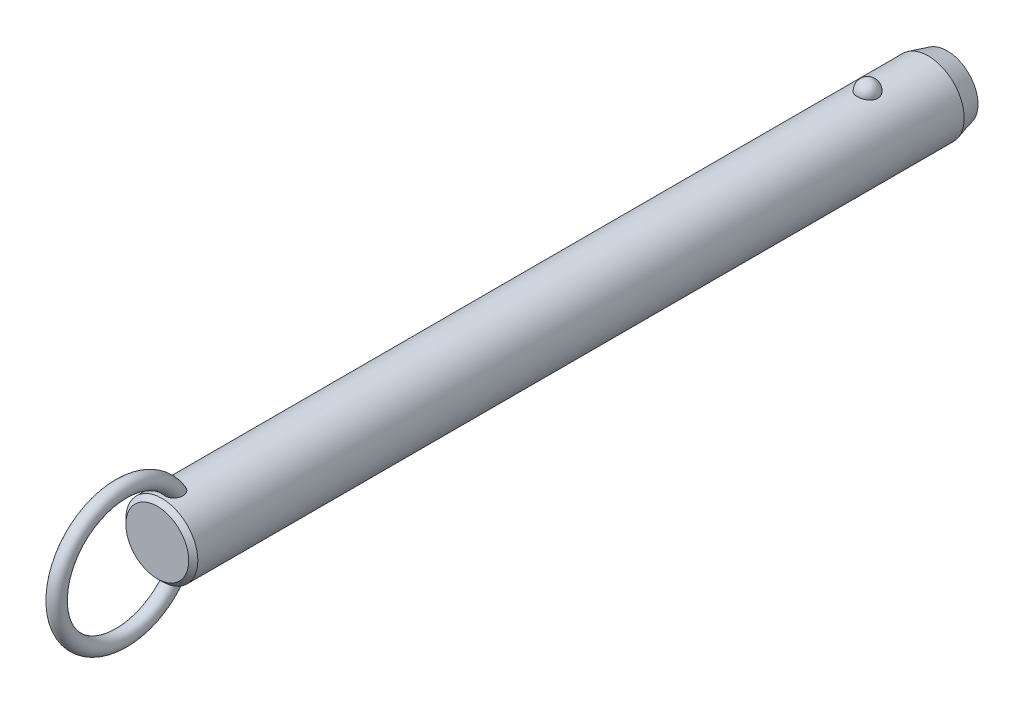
ISO-10303-21;
HEADER;
FILE_DESCRIPTION(('STEP AP214'),'2;1');
FILE_NAME('part.step','',(''),(''),'','','');
FILE_SCHEMA(('AUTOMOTIVE_DESIGN { 1 0 10303 214 1 1 1 1 }'));
ENDSEC;
DATA;
#1=APPLICATION_CONTEXT('core data for automotive mechanical design processes');
#2=APPLICATION_PROTOCOL_DEFINITION('international standard','automotive_design',2000,#1);
#3=PRODUCT_CONTEXT('',#1,'mechanical');
#4=PRODUCT('Part','Part','',(#3));
#5=PRODUCT_RELATED_PRODUCT_CATEGORY('part','',(#4));
#6=PRODUCT_DEFINITION_FORMATION('','',#4);
#7=PRODUCT_DEFINITION_CONTEXT('part definition',#1,'design');
#8=PRODUCT_DEFINITION('design','',#6,#7);
#9=PRODUCT_DEFINITION_SHAPE('','',#8);
#10=(LENGTH_UNIT() NAMED_UNIT(*) SI_UNIT(.MILLI.,.METRE.));
#11=(NAMED_UNIT(*) PLANE_ANGLE_UNIT() SI_UNIT($,.RADIAN.));
#12=(NAMED_UNIT(*) SI_UNIT($,.STERADIAN.) SOLID_ANGLE_UNIT());
#13=UNCERTAINTY_MEASURE_WITH_UNIT(LENGTH_MEASURE(1.E-05),#10,'distance_accuracy_value','');
#14=(GEOMETRIC_REPRESENTATION_CONTEXT(3) GLOBAL_UNCERTAINTY_ASSIGNED_CONTEXT((#13)) GLOBAL_UNIT_ASSIGNED_CONTEXT((#10,
#11,#12)) REPRESENTATION_CONTEXT('',''));
#15=CARTESIAN_POINT('',(0.,0.,0.));
#16=DIRECTION('',(0.,0.,1.));
#17=DIRECTION('',(1.,0.,0.));
#18=AXIS2_PLACEMENT_3D('',#15,#16,#17);
#19=CARTESIAN_POINT('',(0.,0.,175.3));
#20=DIRECTION('',(0.,0.,-1.));
#21=DIRECTION('',(-1.,0.,0.));
#22=AXIS2_PLACEMENT_3D('',#19,#20,#21);
#23=CYLINDRICAL_SURFACE('',#22,9.5);
#24=CARTESIAN_POINT('',(2.67259918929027,9.11631578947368,-2.70000000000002));
#25=CARTESIAN_POINT('',(2.6725968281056,9.11631786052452,-2.54909854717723));
#26=CARTESIAN_POINT('',(2.66030567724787,9.11994722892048,-2.39816735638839));
#27=CARTESIAN_POINT('',(2.6114347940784,9.13405924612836,-2.10058568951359));
#28=CARTESIAN_POINT('',(2.57484658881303,9.14454428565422,-1.95393672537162));
#29=CARTESIAN_POINT('',(2.47830875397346,9.17117631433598,-1.66916069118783));
#30=CARTESIAN_POINT('',(2.41836936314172,9.18732082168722,-1.53102991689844));
#31=CARTESIAN_POINT('',(2.27661331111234,9.22346780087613,-1.26705393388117));
#32=CARTESIAN_POINT('',(2.19479699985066,9.24347021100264,-1.14120852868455));
#33=CARTESIAN_POINT('',(2.01085282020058,9.28522401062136,-0.904632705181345));
#34=CARTESIAN_POINT('',(1.90862396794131,9.30698376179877,-0.793982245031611));
#35=CARTESIAN_POINT('',(1.6867437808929,9.34973971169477,-0.59160721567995));
#36=CARTESIAN_POINT('',(1.56709244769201,9.37073591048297,-0.499882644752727));
#37=CARTESIAN_POINT('',(1.31393976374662,9.40956370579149,-0.338167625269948));
#38=CARTESIAN_POINT('',(1.18048026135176,9.42740444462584,-0.268113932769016));
#39=CARTESIAN_POINT('',(0.903154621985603,9.45799906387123,-0.151390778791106));
#40=CARTESIAN_POINT('',(0.759289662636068,9.47075351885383,-0.104718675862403));
#41=CARTESIAN_POINT('',(0.468074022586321,9.48956256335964,-0.0367633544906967));
#42=CARTESIAN_POINT('',(0.320836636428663,9.49573643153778,-0.0150275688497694));
#43=CARTESIAN_POINT('',(0.0246714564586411,9.50112183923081,0.00396199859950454));
#44=CARTESIAN_POINT('',(-0.124256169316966,9.50033406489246,0.00121819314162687));
#45=CARTESIAN_POINT('',(-0.417264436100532,9.4919475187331,-0.0284441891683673));
#46=CARTESIAN_POINT('',(-0.56138413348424,9.48444885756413,-0.0550074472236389));
#47=CARTESIAN_POINT('',(-0.842986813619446,9.46357853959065,-0.131064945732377));
#48=CARTESIAN_POINT('',(-0.980469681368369,9.450206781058,-0.180559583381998));
#49=CARTESIAN_POINT('',(-1.24585005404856,9.41890822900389,-0.301476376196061));
#50=CARTESIAN_POINT('',(-1.37368611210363,9.40095498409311,-0.373026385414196));
#51=CARTESIAN_POINT('',(-1.61552738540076,9.36242964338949,-0.536025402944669));
#52=CARTESIAN_POINT('',(-1.72953116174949,9.34185727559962,-0.627476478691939));
#53=CARTESIAN_POINT('',(-1.9429225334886,9.29984568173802,-0.829844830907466));
#54=CARTESIAN_POINT('',(-2.04198021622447,9.27839736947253,-0.941108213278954));
#55=CARTESIAN_POINT('',(-2.22026460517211,9.23735994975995,-1.17883414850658));
#56=CARTESIAN_POINT('',(-2.29948985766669,9.21777097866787,-1.30529781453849));
#57=CARTESIAN_POINT('',(-2.43697287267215,9.18238994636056,-1.57158566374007));
#58=CARTESIAN_POINT('',(-2.49497068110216,9.16664569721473,-1.71155057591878));
#59=CARTESIAN_POINT('',(-2.5872073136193,9.14104303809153,-1.99961197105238));
#60=CARTESIAN_POINT('',(-2.62144683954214,9.13118445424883,-2.1477082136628));
#61=CARTESIAN_POINT('',(-2.66521466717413,9.11850622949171,-2.44715424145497));
#62=CARTESIAN_POINT('',(-2.67484831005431,9.11565658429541,-2.59848735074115));
#63=CARTESIAN_POINT('',(-2.66946735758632,9.11723375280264,-2.90067317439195));
#64=CARTESIAN_POINT('',(-2.65445345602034,9.12166036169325,-3.05152590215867));
#65=CARTESIAN_POINT('',(-2.60029711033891,9.13724422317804,-3.34766110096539));
#66=CARTESIAN_POINT('',(-2.56127978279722,9.14836656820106,-3.49296833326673));
#67=CARTESIAN_POINT('',(-2.46018844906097,9.17606676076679,-3.77477535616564));
#68=CARTESIAN_POINT('',(-2.39811349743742,9.1926448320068,-3.91127478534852));
#69=CARTESIAN_POINT('',(-2.25202303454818,9.22952198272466,-4.17244273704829));
#70=CARTESIAN_POINT('',(-2.16788714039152,9.24984129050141,-4.29704106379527));
#71=CARTESIAN_POINT('',(-1.9799408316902,9.29188255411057,-4.53013066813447));
#72=CARTESIAN_POINT('',(-1.87612963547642,9.31360456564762,-4.63862130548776));
#73=CARTESIAN_POINT('',(-1.65105429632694,9.35612959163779,-4.83690299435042));
#74=CARTESIAN_POINT('',(-1.52972405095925,9.37692871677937,-4.9266199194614));
#75=CARTESIAN_POINT('',(-1.27318250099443,9.41518970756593,-5.08429106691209));
#76=CARTESIAN_POINT('',(-1.13797219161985,9.432651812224,-5.15224684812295));
#77=CARTESIAN_POINT('',(-0.859280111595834,9.46208255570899,-5.26371827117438));
#78=CARTESIAN_POINT('',(-0.715925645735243,9.47411833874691,-5.30753421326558));
#79=CARTESIAN_POINT('',(-0.423550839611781,9.4916822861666,-5.37076321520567));
#80=CARTESIAN_POINT('',(-0.2745312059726,9.49721125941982,-5.39017930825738));
#81=CARTESIAN_POINT('',(0.0218446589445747,9.50110860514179,-5.40390587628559));
#82=CARTESIAN_POINT('',(0.16917707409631,9.49961381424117,-5.39869609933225));
#83=CARTESIAN_POINT('',(0.460808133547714,9.48993906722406,-5.36441955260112));
#84=CARTESIAN_POINT('',(0.605106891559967,9.48175936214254,-5.33535367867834));
#85=CARTESIAN_POINT('',(0.886027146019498,9.4596376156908,-5.25435587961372));
#86=CARTESIAN_POINT('',(1.02267710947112,9.44571881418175,-5.20251612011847));
#87=CARTESIAN_POINT('',(1.28523827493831,9.41358993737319,-5.07741549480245));
#88=CARTESIAN_POINT('',(1.41114877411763,9.39537958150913,-5.00415322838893));
#89=CARTESIAN_POINT('',(1.65085227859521,9.3562644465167,-4.83684599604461));
#90=CARTESIAN_POINT('',(1.76442346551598,9.33532178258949,-4.74249218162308));
#91=CARTESIAN_POINT('',(1.97425672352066,9.29321198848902,-4.53620389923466));
#92=CARTESIAN_POINT('',(2.07051582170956,9.27204482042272,-4.42426641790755));
#93=CARTESIAN_POINT('',(2.24490086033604,9.23139221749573,-4.18363183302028));
#94=CARTESIAN_POINT('',(2.32267019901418,9.21194380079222,-4.05466990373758));
#95=CARTESIAN_POINT('',(2.45584092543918,9.1773419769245,-3.78517836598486));
#96=CARTESIAN_POINT('',(2.5112497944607,9.16218713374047,-3.644652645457));
#97=CARTESIAN_POINT('',(2.59380876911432,9.13913522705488,-3.37104301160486));
#98=CARTESIAN_POINT('',(2.62330266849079,9.13064624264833,-3.23871053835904));
#99=CARTESIAN_POINT('',(2.66269870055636,9.11923566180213,-2.97092664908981));
#100=CARTESIAN_POINT('',(2.67260130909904,9.11631393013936,-2.83547530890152));
#101=CARTESIAN_POINT('',(2.67259918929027,9.11631578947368,-2.70000000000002));
#102=B_SPLINE_CURVE_WITH_KNOTS('',3,(#24,#25,#26,#27,#28,#29,#30,#31,#32,#33,#34,#35,#36,#37,
#38,#39,#40,#41,#42,#43,#44,#45,#46,#47,#48,#49,#50,#51,#52,#53,#54,#55,#56,#57,#58,#59,#60,#61,
#62,#63,#64,#65,#66,#67,#68,#69,#70,#71,#72,#73,#74,#75,#76,#77,#78,#79,#80,#81,#82,#83,#84,#85,
#86,#87,#88,#89,#90,#91,#92,#93,#94,#95,#96,#97,#98,#99,#100,#101),.UNSPECIFIED.,.T.,.F.,(4,2,2,
2,2,2,2,2,2,2,2,2,2,2,2,2,2,2,2,2,2,2,2,2,2,2,2,2,2,2,2,2,2,2,2,2,2,2,4),(0.,0.452217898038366,
0.904593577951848,1.35677112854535,1.80894144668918,2.26340676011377,2.71787203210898,
3.17099820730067,3.62407318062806,4.0687883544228,4.51345969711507,4.95160616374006,
5.38976021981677,5.83050358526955,6.27129275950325,6.72071308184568,7.17016633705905,
7.62495278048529,8.07972578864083,8.53254856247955,8.98535859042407,9.43582813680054,
9.88631615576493,10.3393155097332,10.7923328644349,11.2471065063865,11.7018475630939,
12.150795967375,12.599688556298,13.0398725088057,13.4800399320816,13.9184421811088,
14.3568730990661,14.802202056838,15.2476074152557,15.7010097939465,16.1542603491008,
16.5602594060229,16.966248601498),.UNSPECIFIED.);
#103=CARTESIAN_POINT('',(2.67259918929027,9.11631578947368,-2.70000000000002));
#104=VERTEX_POINT('',#103);
#105=EDGE_CURVE('E41',#104,#104,#102,.T.);
#106=ORIENTED_EDGE('',*,*,#105,.T.);
#107=EDGE_LOOP('',(#106));
#108=FACE_BOUND('',#107,.T.);
#109=CARTESIAN_POINT('',(0.,0.,183.62));
#110=DIRECTION('',(0.,0.,1.));
#111=DIRECTION('',(1.,0.,0.));
#112=AXIS2_PLACEMENT_3D('',#109,#110,#111);
#113=CIRCLE('',#112,9.5);
#114=CARTESIAN_POINT('',(9.5,0.,183.62));
#115=VERTEX_POINT('',#114);
#116=EDGE_CURVE('E10',#115,#115,#113,.F.);
#117=ORIENTED_EDGE('',*,*,#116,.T.);
#118=EDGE_LOOP('',(#117));
#119=FACE_BOUND('',#118,.T.);
#120=CARTESIAN_POINT('',(-0.697062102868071,-9.47439269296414,177.967808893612));
#121=CARTESIAN_POINT('',(-0.799579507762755,-9.46685146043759,178.007482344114));
#122=CARTESIAN_POINT('',(-0.898575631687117,-9.45788043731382,178.0559309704));
#123=CARTESIAN_POINT('',(-1.08670047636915,-9.43811593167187,178.168868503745));
#124=CARTESIAN_POINT('',(-1.17583204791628,-9.42732297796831,178.233352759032));
#125=CARTESIAN_POINT('',(-1.34179806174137,-9.40513672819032,178.376209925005));
#126=CARTESIAN_POINT('',(-1.41865133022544,-9.39374438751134,178.454561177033));
#127=CARTESIAN_POINT('',(-1.55860047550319,-9.37154196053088,178.622752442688));
#128=CARTESIAN_POINT('',(-1.62169476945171,-9.3607319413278,178.71259377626));
#129=CARTESIAN_POINT('',(-1.73527695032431,-9.34035749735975,178.904500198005));
#130=CARTESIAN_POINT('',(-1.78522266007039,-9.33085270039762,179.006891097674));
#131=CARTESIAN_POINT('',(-1.86924997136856,-9.3143834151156,179.218148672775));
#132=CARTESIAN_POINT('',(-1.90332570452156,-9.30741986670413,179.327017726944));
#133=CARTESIAN_POINT('',(-1.95893603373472,-9.29588482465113,179.560473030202));
#134=CARTESIAN_POINT('',(-1.97872420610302,-9.29165182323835,179.685489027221));
#135=CARTESIAN_POINT('',(-2.00062129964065,-9.28695978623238,179.937080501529));
#136=CARTESIAN_POINT('',(-2.00272284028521,-9.28650232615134,180.063656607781));
#137=CARTESIAN_POINT('',(-1.98958876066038,-9.28932750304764,180.336815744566));
#138=CARTESIAN_POINT('',(-1.97143366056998,-9.2932400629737,180.483251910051));
#139=CARTESIAN_POINT('',(-1.91479925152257,-9.30507151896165,180.772062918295));
#140=CARTESIAN_POINT('',(-1.87629122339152,-9.31299607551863,180.914431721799));
#141=CARTESIAN_POINT('',(-1.77225683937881,-9.33340232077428,181.215172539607));
#142=CARTESIAN_POINT('',(-1.70334898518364,-9.34641636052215,181.372369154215));
#143=CARTESIAN_POINT('',(-1.58111062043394,-9.36759153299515,181.597517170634));
#144=CARTESIAN_POINT('',(-1.53721459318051,-9.37492619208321,181.670796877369));
#145=CARTESIAN_POINT('',(-1.4430263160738,-9.38988566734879,181.81307405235));
#146=CARTESIAN_POINT('',(-1.39273721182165,-9.39751033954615,181.882073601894));
#147=CARTESIAN_POINT('',(-1.26775962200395,-9.41530678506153,182.036983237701));
#148=CARTESIAN_POINT('',(-1.19052326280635,-9.42548108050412,182.120871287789));
#149=CARTESIAN_POINT('',(-1.02420241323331,-9.44499825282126,182.276008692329));
#150=CARTESIAN_POINT('',(-0.93513986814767,-9.45434261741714,182.347280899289));
#151=CARTESIAN_POINT('',(-0.766610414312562,-9.46930670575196,182.458695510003));
#152=CARTESIAN_POINT('',(-0.689439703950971,-9.47529223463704,182.502235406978));
#153=CARTESIAN_POINT('',(-0.528942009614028,-9.48560294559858,182.57631336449));
#154=CARTESIAN_POINT('',(-0.445620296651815,-9.48992953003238,182.606862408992));
#155=CARTESIAN_POINT('',(-0.273901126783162,-9.49644161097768,182.652579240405));
#156=CARTESIAN_POINT('',(-0.18546574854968,-9.49860811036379,182.66761059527));
#157=CARTESIAN_POINT('',(-0.00734541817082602,-9.5004135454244,182.680149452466));
#158=CARTESIAN_POINT('',(0.0823387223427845,-9.50005405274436,182.677667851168));
#159=CARTESIAN_POINT('',(0.24767927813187,-9.49708301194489,182.656995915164));
#160=CARTESIAN_POINT('',(0.323620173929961,-9.49477609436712,182.640930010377));
#161=CARTESIAN_POINT('',(0.471981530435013,-9.48855917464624,182.597172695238));
#162=CARTESIAN_POINT('',(0.544400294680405,-9.48464840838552,182.569475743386));
#163=CARTESIAN_POINT('',(0.708947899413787,-9.47398336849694,182.49280266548));
#164=CARTESIAN_POINT('',(0.799149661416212,-9.46671310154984,182.439774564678));
#165=CARTESIAN_POINT('',(0.969783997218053,-9.45076225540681,182.319973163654));
#166=CARTESIAN_POINT('',(1.050194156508,-9.44207854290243,182.253169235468));
#167=CARTESIAN_POINT('',(1.23092343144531,-9.42051459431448,182.080759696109));
#168=CARTESIAN_POINT('',(1.32652499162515,-9.40733378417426,181.97026193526));
#169=CARTESIAN_POINT('',(1.49893121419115,-9.38140745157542,181.735561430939));
#170=CARTESIAN_POINT('',(1.5757161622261,-9.36866239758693,181.611344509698));
#171=CARTESIAN_POINT('',(1.71285426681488,-9.34457644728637,181.349389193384));
#172=CARTESIAN_POINT('',(1.77266365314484,-9.3332872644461,181.21136233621));
#173=CARTESIAN_POINT('',(1.87239208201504,-9.31379209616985,180.928051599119));
#174=CARTESIAN_POINT('',(1.91230158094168,-9.3055875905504,180.782764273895));
#175=CARTESIAN_POINT('',(1.97604189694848,-9.29228394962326,180.462028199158));
#176=CARTESIAN_POINT('',(1.9958743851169,-9.28797202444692,180.285724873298));
#177=CARTESIAN_POINT('',(2.0029570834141,-9.28645519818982,179.932414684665));
#178=CARTESIAN_POINT('',(1.99025930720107,-9.28923895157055,179.755409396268));
#179=CARTESIAN_POINT('',(1.93735479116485,-9.30038134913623,179.456338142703));
#180=CARTESIAN_POINT('',(1.90576827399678,-9.30697680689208,179.332667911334));
#181=CARTESIAN_POINT('',(1.8228748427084,-9.32356855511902,179.092329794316));
#182=CARTESIAN_POINT('',(1.77158213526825,-9.33356239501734,178.975656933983));
#183=CARTESIAN_POINT('',(1.64885744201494,-9.35602275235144,178.752706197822));
#184=CARTESIAN_POINT('',(1.57730995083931,-9.36850332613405,178.646492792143));
#185=CARTESIAN_POINT('',(1.41543264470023,-9.39431873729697,178.449553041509));
#186=CARTESIAN_POINT('',(1.32510883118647,-9.40765330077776,178.358821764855));
#187=CARTESIAN_POINT('',(1.13846223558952,-9.43195720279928,178.205033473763));
#188=CARTESIAN_POINT('',(1.04369890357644,-9.44302894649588,178.140094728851));
#189=CARTESIAN_POINT('',(0.843965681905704,-9.46296805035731,178.028038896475));
#190=CARTESIAN_POINT('',(0.739000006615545,-9.47183631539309,177.980914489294));
#191=CARTESIAN_POINT('',(0.528175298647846,-9.48586140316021,177.908117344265));
#192=CARTESIAN_POINT('',(0.422686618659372,-9.49119633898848,177.88140249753));
#193=CARTESIAN_POINT('',(0.208590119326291,-9.49831365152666,177.846013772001));
#194=CARTESIAN_POINT('',(0.0999817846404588,-9.500095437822,177.837342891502));
#195=CARTESIAN_POINT('',(-0.126104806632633,-9.49988861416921,177.838350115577));
#196=CARTESIAN_POINT('',(-0.243578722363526,-9.49757821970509,177.849594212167));
#197=CARTESIAN_POINT('',(-0.474390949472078,-9.48885165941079,177.893167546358));
#198=CARTESIAN_POINT('',(-0.587729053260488,-9.48243528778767,177.925497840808));
#199=CARTESIAN_POINT('',(-0.697062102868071,-9.47439269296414,177.967808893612));
#200=B_SPLINE_CURVE_WITH_KNOTS('',3,(#120,#121,#122,#123,#124,#125,#126,#127,#128,#129,#130,
#131,#132,#133,#134,#135,#136,#137,#138,#139,#140,#141,#142,#143,#144,#145,#146,#147,#148,#149,
#150,#151,#152,#153,#154,#155,#156,#157,#158,#159,#160,#161,#162,#163,#164,#165,#166,#167,#168,
#169,#170,#171,#172,#173,#174,#175,#176,#177,#178,#179,#180,#181,#182,#183,#184,#185,#186,#187,
#188,#189,#190,#191,#192,#193,#194,#195,#196,#197,#198,#199),.UNSPECIFIED.,.T.,.F.,(4,2,2,2,2,2,
2,2,2,2,2,2,2,2,2,2,2,2,2,2,2,2,2,2,2,2,2,2,2,2,2,2,2,2,2,2,2,2,2,4),(0.,0.330119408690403,
0.660143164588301,0.989655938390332,1.31920659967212,1.66074728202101,2.00241415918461,
2.38088696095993,2.75951768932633,3.20065679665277,3.64242004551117,4.15620996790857,
4.4131416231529,4.66994734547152,5.01228664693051,5.35399933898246,5.61943037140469,
5.88463652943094,6.15215502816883,6.4195070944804,6.65144391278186,6.88349136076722,
7.19641200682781,7.51003602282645,7.94779711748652,8.3860149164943,8.83699707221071,
9.28819530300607,9.81778662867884,10.34653170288,10.7284172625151,11.1100280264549,
11.4938603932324,11.8775702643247,12.2220189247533,12.5663259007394,12.8915939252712,
13.2169159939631,13.5689650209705,13.9210316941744),.UNSPECIFIED.);
#201=CARTESIAN_POINT('',(-0.697062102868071,-9.47439269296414,177.967808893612));
#202=VERTEX_POINT('',#201);
#203=EDGE_CURVE('E58',#202,#202,#200,.T.);
#204=ORIENTED_EDGE('',*,*,#203,.T.);
#205=EDGE_LOOP('',(#204));
#206=FACE_BOUND('',#205,.T.);
#207=CARTESIAN_POINT('',(-0.697062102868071,9.47439269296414,177.967808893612));
#208=CARTESIAN_POINT('',(-0.597792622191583,9.48169483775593,177.92939564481));
#209=CARTESIAN_POINT('',(-0.495106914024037,9.48766580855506,177.899168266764));
#210=CARTESIAN_POINT('',(-0.285876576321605,9.49627648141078,177.856032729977));
#211=CARTESIAN_POINT('',(-0.179324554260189,9.49890941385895,177.843159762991));
#212=CARTESIAN_POINT('',(0.0344157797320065,9.50053798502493,177.835166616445));
#213=CARTESIAN_POINT('',(0.141603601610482,9.49953613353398,177.840034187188));
#214=CARTESIAN_POINT('',(0.35356357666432,9.49401038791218,177.867365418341));
#215=CARTESIAN_POINT('',(0.458336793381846,9.48948807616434,177.88982117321));
#216=CARTESIAN_POINT('',(0.662493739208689,9.4774236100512,177.951671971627));
#217=CARTESIAN_POINT('',(0.761881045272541,9.46988348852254,177.991055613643));
#218=CARTESIAN_POINT('',(0.95260839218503,9.45260382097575,178.085634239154));
#219=CARTESIAN_POINT('',(1.04394806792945,9.44286417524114,178.140829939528));
#220=CARTESIAN_POINT('',(1.21712767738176,9.42211760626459,178.266066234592));
#221=CARTESIAN_POINT('',(1.29885671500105,9.41109835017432,178.336257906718));
#222=CARTESIAN_POINT('',(1.44978975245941,9.38903310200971,178.488980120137));
#223=CARTESIAN_POINT('',(1.51899278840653,9.37798710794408,178.571511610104));
#224=CARTESIAN_POINT('',(1.64602857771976,9.35654375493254,178.749776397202));
#225=CARTESIAN_POINT('',(1.70333052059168,9.34618688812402,178.845891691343));
#226=CARTESIAN_POINT('',(1.80259341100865,9.32755128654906,179.045897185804));
#227=CARTESIAN_POINT('',(1.84454942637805,9.31927322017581,179.149789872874));
#228=CARTESIAN_POINT('',(1.91637039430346,9.30478365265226,179.372213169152));
#229=CARTESIAN_POINT('',(1.944805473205,9.29882552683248,179.491219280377));
#230=CARTESIAN_POINT('',(1.98449865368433,9.29043398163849,179.732143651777));
#231=CARTESIAN_POINT('',(1.99574908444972,9.28800213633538,179.854063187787));
#232=CARTESIAN_POINT('',(2.00275141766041,9.28649645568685,180.116932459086));
#233=CARTESIAN_POINT('',(1.99588238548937,9.28799035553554,180.257952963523));
#234=CARTESIAN_POINT('',(1.96270559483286,9.29505517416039,180.537621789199));
#235=CARTESIAN_POINT('',(1.93637872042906,9.30063010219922,180.676267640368));
#236=CARTESIAN_POINT('',(1.85949176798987,9.31633564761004,180.972561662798));
#237=CARTESIAN_POINT('',(1.80549792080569,9.3270926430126,181.129290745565));
#238=CARTESIAN_POINT('',(1.67376869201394,9.3516306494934,181.432284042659));
#239=CARTESIAN_POINT('',(1.59603181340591,9.36541185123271,181.578547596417));
#240=CARTESIAN_POINT('',(1.4360277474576,9.39110706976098,181.825813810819));
#241=CARTESIAN_POINT('',(1.35831795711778,9.40278656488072,181.929791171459));
#242=CARTESIAN_POINT('',(1.18774483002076,9.42585025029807,182.124534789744));
#243=CARTESIAN_POINT('',(1.09490932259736,9.43723493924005,182.215324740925));
#244=CARTESIAN_POINT('',(0.921110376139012,9.45552616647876,182.35620334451));
#245=CARTESIAN_POINT('',(0.843738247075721,9.46281058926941,182.410656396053));
#246=CARTESIAN_POINT('',(0.681245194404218,9.47589120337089,182.506711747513));
#247=CARTESIAN_POINT('',(0.596135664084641,9.48168953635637,182.548332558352));
#248=CARTESIAN_POINT('',(0.433779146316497,9.49038144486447,182.610089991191));
#249=CARTESIAN_POINT('',(0.357459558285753,9.49359170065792,182.63260136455));
#250=CARTESIAN_POINT('',(0.202074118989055,9.49816761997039,182.664574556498));
#251=CARTESIAN_POINT('',(0.123010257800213,9.49953459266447,182.674045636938));
#252=CARTESIAN_POINT('',(-0.03573724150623,9.50026497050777,182.679114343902));
#253=CARTESIAN_POINT('',(-0.115421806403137,9.49962433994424,182.674684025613));
#254=CARTESIAN_POINT('',(-0.272823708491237,9.49640854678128,182.652296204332));
#255=CARTESIAN_POINT('',(-0.350540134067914,9.4938325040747,182.634332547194));
#256=CARTESIAN_POINT('',(-0.500580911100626,9.48709462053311,182.586802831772));
#257=CARTESIAN_POINT('',(-0.572979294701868,9.48296359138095,182.557461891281));
#258=CARTESIAN_POINT('',(-0.712864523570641,9.47347609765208,182.489008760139));
#259=CARTESIAN_POINT('',(-0.780349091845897,9.46811906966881,182.449892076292));
#260=CARTESIAN_POINT('',(-0.946309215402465,9.45329720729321,182.339432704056));
#261=CARTESIAN_POINT('',(-1.04090230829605,9.44321512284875,182.262329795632));
#262=CARTESIAN_POINT('',(-1.21661929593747,9.42219227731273,182.09409718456));
#263=CARTESIAN_POINT('',(-1.29770519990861,9.41124921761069,182.002929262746));
#264=CARTESIAN_POINT('',(-1.47319646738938,9.38563439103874,181.776162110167));
#265=CARTESIAN_POINT('',(-1.56208878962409,9.37102009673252,181.636289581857));
#266=CARTESIAN_POINT('',(-1.71623987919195,9.34401559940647,181.343950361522));
#267=CARTESIAN_POINT('',(-1.78147866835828,9.33162728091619,181.191473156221));
#268=CARTESIAN_POINT('',(-1.88853837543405,9.31055541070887,180.875647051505));
#269=CARTESIAN_POINT('',(-1.92998995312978,9.30193076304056,180.712168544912));
#270=CARTESIAN_POINT('',(-1.98590726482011,9.29015757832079,180.380526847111));
#271=CARTESIAN_POINT('',(-2.0004070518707,9.2870021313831,180.212369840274));
#272=CARTESIAN_POINT('',(-1.99964701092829,9.28716218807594,179.905080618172));
#273=CARTESIAN_POINT('',(-1.98908145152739,9.28945704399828,179.765936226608));
#274=CARTESIAN_POINT('',(-1.94566294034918,9.29865169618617,179.491153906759));
#275=CARTESIAN_POINT('',(-1.9128206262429,9.30554929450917,179.355514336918));
#276=CARTESIAN_POINT('',(-1.84582133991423,9.31898248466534,179.157802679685));
#277=CARTESIAN_POINT('',(-1.82038084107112,9.32400364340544,179.092583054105));
#278=CARTESIAN_POINT('',(-1.76350511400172,9.33492884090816,178.964903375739));
#279=CARTESIAN_POINT('',(-1.73207305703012,9.34083241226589,178.902441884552));
#280=CARTESIAN_POINT('',(-1.66324243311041,9.353333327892,178.78094078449));
#281=CARTESIAN_POINT('',(-1.625842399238,9.35993084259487,178.721902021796));
#282=CARTESIAN_POINT('',(-1.54527678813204,9.37356864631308,178.607987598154));
#283=CARTESIAN_POINT('',(-1.50211241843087,9.38060884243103,178.553111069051));
#284=CARTESIAN_POINT('',(-1.37681147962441,9.40004442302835,178.409961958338));
#285=CARTESIAN_POINT('',(-1.28916358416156,9.41261047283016,178.326429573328));
#286=CARTESIAN_POINT('',(-1.09996826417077,9.43658180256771,178.177236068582));
#287=CARTESIAN_POINT('',(-0.998461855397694,9.44799034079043,178.111523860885));
#288=CARTESIAN_POINT('',(-0.860188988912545,9.46103017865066,178.0394367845));
#289=CARTESIAN_POINT('',(-0.828141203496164,9.46389141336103,178.023851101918));
#290=CARTESIAN_POINT('',(-0.763210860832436,9.46934915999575,177.994473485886));
#291=CARTESIAN_POINT('',(-0.730328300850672,9.47194567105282,177.980681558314));
#292=CARTESIAN_POINT('',(-0.697062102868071,9.47439269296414,177.967808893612));
#293=B_SPLINE_CURVE_WITH_KNOTS('',3,(#207,#208,#209,#210,#211,#212,#213,#214,#215,#216,#217,
#218,#219,#220,#221,#222,#223,#224,#225,#226,#227,#228,#229,#230,#231,#232,#233,#234,#235,#236,
#237,#238,#239,#240,#241,#242,#243,#244,#245,#246,#247,#248,#249,#250,#251,#252,#253,#254,#255,
#256,#257,#258,#259,#260,#261,#262,#263,#264,#265,#266,#267,#268,#269,#270,#271,#272,#273,#274,
#275,#276,#277,#278,#279,#280,#281,#282,#283,#284,#285,#286,#287,#288,#289,#290,#291,#292),
.UNSPECIFIED.,.T.,.F.,(4,2,2,2,2,2,2,2,2,2,2,2,2,2,2,2,2,2,2,2,2,2,2,2,2,2,2,2,2,2,2,2,2,2,2,2,
2,2,2,2,2,2,4),(0.,0.319942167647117,0.640532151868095,0.96090081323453,1.2811255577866,
1.60113495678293,1.92115886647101,2.24457323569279,2.56801248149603,2.90371927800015,
3.23953387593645,3.60560313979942,3.97183576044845,4.39383693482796,4.8162532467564,
5.31257045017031,5.80891895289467,6.19868344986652,6.58773876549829,6.87145417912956,
7.15475838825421,7.39263751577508,7.63034760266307,7.86853584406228,8.10683246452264,
8.3406366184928,8.57454843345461,8.93983939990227,9.30614105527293,9.80266668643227,
10.2996107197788,10.8040753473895,11.3079021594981,11.7249776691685,12.1418541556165,
12.3521485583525,12.5623319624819,12.7725671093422,12.9827582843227,13.345827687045,
13.7078449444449,13.8150604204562,13.9222762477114),.UNSPECIFIED.);
#294=CARTESIAN_POINT('',(-0.697062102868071,9.47439269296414,177.967808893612));
#295=VERTEX_POINT('',#294);
#296=EDGE_CURVE('E66',#295,#295,#293,.T.);
#297=ORIENTED_EDGE('',*,*,#296,.T.);
#298=EDGE_LOOP('',(#297));
#299=FACE_BOUND('',#298,.T.);
#300=CARTESIAN_POINT('',(0.,0.,-18.6999999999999));
#301=DIRECTION('',(0.,0.,-1.));
#302=DIRECTION('',(-1.,0.,0.));
#303=AXIS2_PLACEMENT_3D('',#300,#301,#302);
#304=CIRCLE('',#303,9.5);
#305=CARTESIAN_POINT('',(-9.5,0.,-18.6999999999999));
#306=VERTEX_POINT('',#305);
#307=EDGE_CURVE('E55',#306,#306,#304,.F.);
#308=ORIENTED_EDGE('',*,*,#307,.T.);
#309=EDGE_LOOP('',(#308));
#310=FACE_BOUND('',#309,.T.);
#311=ADVANCED_FACE('F37',(#108,#119,#206,#299,#310),#23,.T.);
#312=CARTESIAN_POINT('',(0.,0.,-23.7));
#313=DIRECTION('',(0.,0.,-1.));
#314=DIRECTION('',(-1.,0.,0.));
#315=AXIS2_PLACEMENT_3D('',#312,#313,#314);
#316=PLANE('',#315);
#317=CARTESIAN_POINT('',(0.,0.,-23.7));
#318=DIRECTION('',(0.,0.,-1.));
#319=DIRECTION('',(-1.,0.,0.));
#320=AXIS2_PLACEMENT_3D('',#317,#318,#319);
#321=CIRCLE('',#320,8.16025403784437);
#322=CARTESIAN_POINT('',(-8.16025403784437,0.,-23.7));
#323=VERTEX_POINT('',#322);
#324=EDGE_CURVE('E65',#323,#323,#321,.T.);
#325=ORIENTED_EDGE('',*,*,#324,.T.);
#326=EDGE_LOOP('',(#325));
#327=FACE_BOUND('',#326,.T.);
#328=ADVANCED_FACE('F84',(#327),#316,.T.);
#329=CARTESIAN_POINT('',(0.,0.,-23.7));
#330=DIRECTION('',(0.,0.,1.));
#331=DIRECTION('',(1.,0.,0.));
#332=AXIS2_PLACEMENT_3D('',#329,#330,#331);
#333=CONICAL_SURFACE('',#332,8.16025403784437,0.261799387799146);
#334=ORIENTED_EDGE('',*,*,#307,.F.);
#335=EDGE_LOOP('',(#334));
#336=FACE_BOUND('',#335,.T.);
#337=ORIENTED_EDGE('',*,*,#324,.F.);
#338=EDGE_LOOP('',(#337));
#339=FACE_BOUND('',#338,.T.);
#340=ADVANCED_FACE('F82',(#336,#339),#333,.T.);
#341=CARTESIAN_POINT('',(0.,0.,184.82));
#342=DIRECTION('',(0.,0.,1.));
#343=DIRECTION('',(1.,0.,0.));
#344=AXIS2_PLACEMENT_3D('',#341,#342,#343);
#345=PLANE('',#344);
#346=CARTESIAN_POINT('',(0.,0.,184.82));
#347=DIRECTION('',(0.,0.,1.));
#348=DIRECTION('',(1.,0.,0.));
#349=AXIS2_PLACEMENT_3D('',#346,#347,#348);
#350=CIRCLE('',#349,8.30000000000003);
#351=CARTESIAN_POINT('',(8.30000000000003,0.,184.82));
#352=VERTEX_POINT('',#351);
#353=EDGE_CURVE('E50',#352,#352,#350,.T.);
#354=ORIENTED_EDGE('',*,*,#353,.T.);
#355=EDGE_LOOP('',(#354));
#356=FACE_BOUND('',#355,.T.);
#357=ADVANCED_FACE('F76',(#356),#345,.T.);
#358=CARTESIAN_POINT('',(0.,0.,194.35));
#359=DIRECTION('',(1.,0.,0.));
#360=DIRECTION('',(0.,0.,-1.));
#361=AXIS2_PLACEMENT_3D('',#358,#359,#360);
#362=TOROIDAL_SURFACE('',#361,17.05,2.);
#363=ORIENTED_EDGE('',*,*,#296,.F.);
#364=EDGE_LOOP('',(#363));
#365=FACE_BOUND('',#364,.T.);
#366=ORIENTED_EDGE('',*,*,#203,.F.);
#367=EDGE_LOOP('',(#366));
#368=FACE_BOUND('',#367,.T.);
#369=ADVANCED_FACE('F72',(#365,#368),#362,.T.);
#370=CARTESIAN_POINT('',(0.,0.,184.82));
#371=DIRECTION('',(0.,0.,-1.));
#372=DIRECTION('',(-1.,0.,0.));
#373=AXIS2_PLACEMENT_3D('',#370,#371,#372);
#374=CONICAL_SURFACE('',#373,8.30000000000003,0.785398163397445);
#375=ORIENTED_EDGE('',*,*,#116,.F.);
#376=EDGE_LOOP('',(#375));
#377=FACE_BOUND('',#376,.T.);
#378=ORIENTED_EDGE('',*,*,#353,.F.);
#379=EDGE_LOOP('',(#378));
#380=FACE_BOUND('',#379,.T.);
#381=ADVANCED_FACE('F39',(#377,#380),#374,.T.);
#382=CARTESIAN_POINT('',(0.,9.5,-2.70000000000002));
#383=DIRECTION('',(0.,1.,0.));
#384=DIRECTION('',(0.,0.,-1.));
#385=AXIS2_PLACEMENT_3D('',#382,#383,#384);
#386=SPHERICAL_SURFACE('',#385,2.7);
#387=ORIENTED_EDGE('',*,*,#105,.F.);
#388=EDGE_LOOP('',(#387));
#389=FACE_BOUND('',#388,.T.);
#390=ADVANCED_FACE('F78',(#389),#386,.T.);
#391=CLOSED_SHELL('',(#311,#328,#340,#357,#369,#381,#390));
#392=MANIFOLD_SOLID_BREP('B2',#391);
#393=ADVANCED_BREP_SHAPE_REPRESENTATION('',(#18,#392),#14);
#394=SHAPE_DEFINITION_REPRESENTATION(#9,#393);
ENDSEC;
END-ISO-10303-21;
